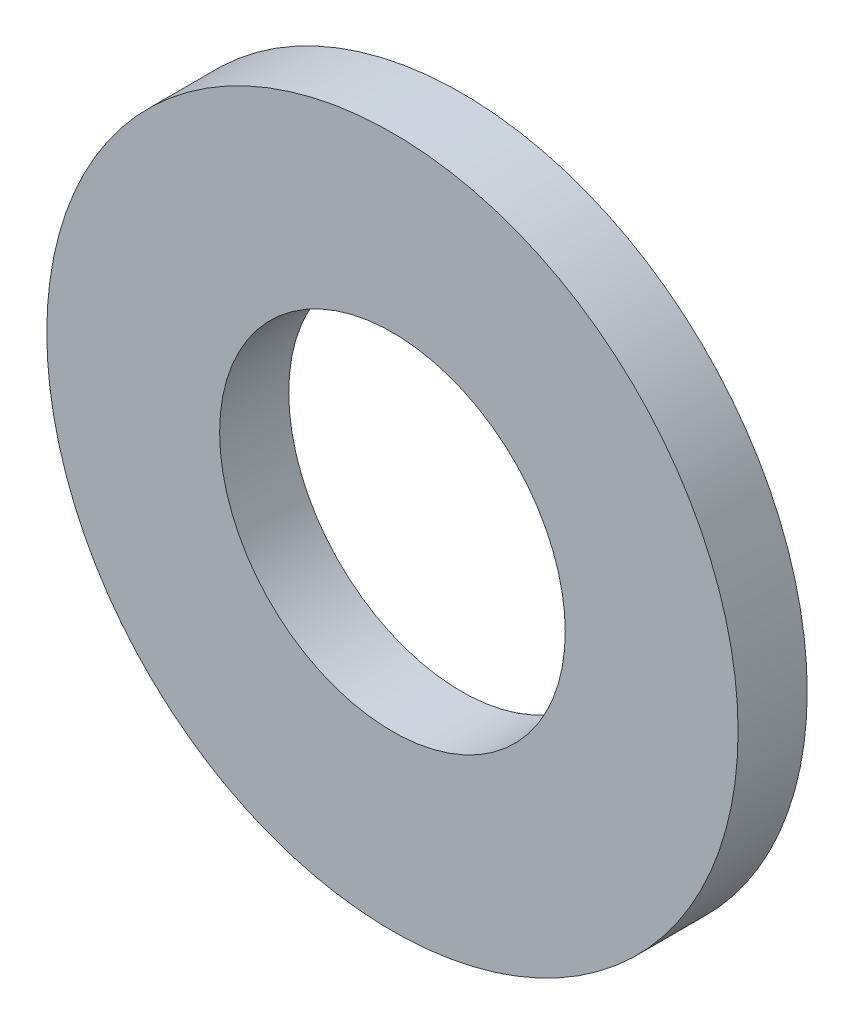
ISO-10303-21;
HEADER;
FILE_DESCRIPTION(('STEP AP214'),'2;1');
FILE_NAME('part.step','',(''),(''),'','','');
FILE_SCHEMA(('AUTOMOTIVE_DESIGN { 1 0 10303 214 1 1 1 1 }'));
ENDSEC;
DATA;
#1=APPLICATION_CONTEXT('core data for automotive mechanical design processes');
#2=APPLICATION_PROTOCOL_DEFINITION('international standard','automotive_design',2000,#1);
#3=PRODUCT_CONTEXT('',#1,'mechanical');
#4=PRODUCT('Part','Part','',(#3));
#5=PRODUCT_RELATED_PRODUCT_CATEGORY('part','',(#4));
#6=PRODUCT_DEFINITION_FORMATION('','',#4);
#7=PRODUCT_DEFINITION_CONTEXT('part definition',#1,'design');
#8=PRODUCT_DEFINITION('design','',#6,#7);
#9=PRODUCT_DEFINITION_SHAPE('','',#8);
#10=(LENGTH_UNIT() NAMED_UNIT(*) SI_UNIT(.MILLI.,.METRE.));
#11=(NAMED_UNIT(*) PLANE_ANGLE_UNIT() SI_UNIT($,.RADIAN.));
#12=(NAMED_UNIT(*) SI_UNIT($,.STERADIAN.) SOLID_ANGLE_UNIT());
#13=UNCERTAINTY_MEASURE_WITH_UNIT(LENGTH_MEASURE(1.E-05),#10,'distance_accuracy_value','');
#14=(GEOMETRIC_REPRESENTATION_CONTEXT(3) GLOBAL_UNCERTAINTY_ASSIGNED_CONTEXT((#13)) GLOBAL_UNIT_ASSIGNED_CONTEXT((#10,
#11,#12)) REPRESENTATION_CONTEXT('',''));
#15=CARTESIAN_POINT('',(0.,0.,0.));
#16=DIRECTION('',(0.,0.,1.));
#17=DIRECTION('',(1.,0.,0.));
#18=AXIS2_PLACEMENT_3D('',#15,#16,#17);
#19=CARTESIAN_POINT('',(0.,0.,2.5));
#20=DIRECTION('',(0.,0.,1.));
#21=DIRECTION('',(1.,0.,0.));
#22=AXIS2_PLACEMENT_3D('',#19,#20,#21);
#23=PLANE('',#22);
#24=CARTESIAN_POINT('',(0.,0.,2.5));
#25=DIRECTION('',(0.,0.,1.));
#26=DIRECTION('',(1.,0.,0.));
#27=AXIS2_PLACEMENT_3D('',#24,#25,#26);
#28=CIRCLE('',#27,12.5);
#29=CARTESIAN_POINT('',(12.5,0.,2.5));
#30=VERTEX_POINT('',#29);
#31=EDGE_CURVE('E10',#30,#30,#28,.T.);
#32=ORIENTED_EDGE('',*,*,#31,.T.);
#33=EDGE_LOOP('',(#32));
#34=FACE_BOUND('',#33,.T.);
#35=CARTESIAN_POINT('',(0.,0.,2.5));
#36=DIRECTION('',(0.,0.,1.));
#37=DIRECTION('',(1.,0.,0.));
#38=AXIS2_PLACEMENT_3D('',#35,#36,#37);
#39=CIRCLE('',#38,6.25);
#40=CARTESIAN_POINT('',(6.25,0.,2.5));
#41=VERTEX_POINT('',#40);
#42=EDGE_CURVE('E46',#41,#41,#39,.T.);
#43=ORIENTED_EDGE('',*,*,#42,.F.);
#44=EDGE_LOOP('',(#43));
#45=FACE_BOUND('',#44,.T.);
#46=ADVANCED_FACE('F35',(#34,#45),#23,.T.);
#47=CARTESIAN_POINT('',(0.,0.,0.));
#48=DIRECTION('',(0.,0.,1.));
#49=DIRECTION('',(1.,0.,0.));
#50=AXIS2_PLACEMENT_3D('',#47,#48,#49);
#51=PLANE('',#50);
#52=CARTESIAN_POINT('',(0.,0.,0.));
#53=DIRECTION('',(0.,0.,1.));
#54=DIRECTION('',(1.,0.,0.));
#55=AXIS2_PLACEMENT_3D('',#52,#53,#54);
#56=CIRCLE('',#55,12.5);
#57=CARTESIAN_POINT('',(12.5,0.,0.));
#58=VERTEX_POINT('',#57);
#59=EDGE_CURVE('E42',#58,#58,#56,.T.);
#60=ORIENTED_EDGE('',*,*,#59,.F.);
#61=EDGE_LOOP('',(#60));
#62=FACE_BOUND('',#61,.T.);
#63=CARTESIAN_POINT('',(0.,0.,0.));
#64=DIRECTION('',(0.,0.,1.));
#65=DIRECTION('',(1.,0.,0.));
#66=AXIS2_PLACEMENT_3D('',#63,#64,#65);
#67=CIRCLE('',#66,6.25);
#68=CARTESIAN_POINT('',(6.25,0.,0.));
#69=VERTEX_POINT('',#68);
#70=EDGE_CURVE('E50',#69,#69,#67,.T.);
#71=ORIENTED_EDGE('',*,*,#70,.T.);
#72=EDGE_LOOP('',(#71));
#73=FACE_BOUND('',#72,.T.);
#74=ADVANCED_FACE('F56',(#62,#73),#51,.F.);
#75=CARTESIAN_POINT('',(0.,0.,2.5));
#76=DIRECTION('',(0.,0.,-1.));
#77=DIRECTION('',(-1.,0.,0.));
#78=AXIS2_PLACEMENT_3D('',#75,#76,#77);
#79=CYLINDRICAL_SURFACE('',#78,12.5);
#80=ORIENTED_EDGE('',*,*,#31,.F.);
#81=EDGE_LOOP('',(#80));
#82=FACE_BOUND('',#81,.T.);
#83=ORIENTED_EDGE('',*,*,#59,.T.);
#84=EDGE_LOOP('',(#83));
#85=FACE_BOUND('',#84,.T.);
#86=ADVANCED_FACE('F37',(#82,#85),#79,.T.);
#87=CARTESIAN_POINT('',(0.,0.,2.5));
#88=DIRECTION('',(0.,0.,-1.));
#89=DIRECTION('',(-1.,0.,0.));
#90=AXIS2_PLACEMENT_3D('',#87,#88,#89);
#91=CYLINDRICAL_SURFACE('',#90,6.25);
#92=ORIENTED_EDGE('',*,*,#42,.T.);
#93=EDGE_LOOP('',(#92));
#94=FACE_BOUND('',#93,.T.);
#95=ORIENTED_EDGE('',*,*,#70,.F.);
#96=EDGE_LOOP('',(#95));
#97=FACE_BOUND('',#96,.T.);
#98=ADVANCED_FACE('F58',(#94,#97),#91,.F.);
#99=CLOSED_SHELL('',(#46,#74,#86,#98));
#100=MANIFOLD_SOLID_BREP('B2',#99);
#101=ADVANCED_BREP_SHAPE_REPRESENTATION('',(#18,#100),#14);
#102=SHAPE_DEFINITION_REPRESENTATION(#9,#101);
ENDSEC;
END-ISO-10303-21;
